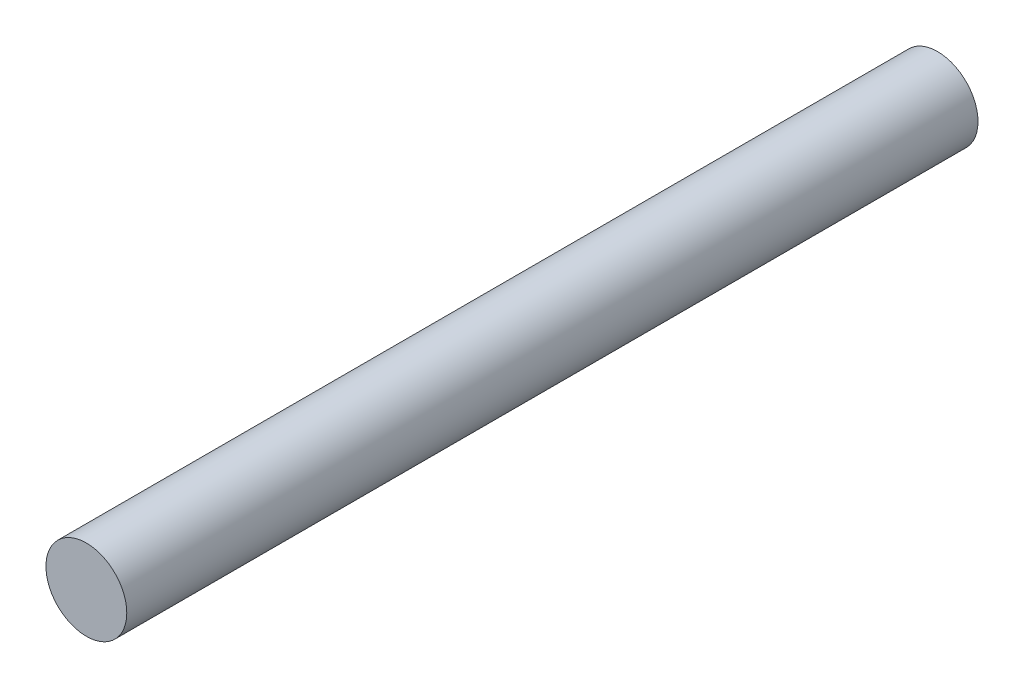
ISO-10303-21;
HEADER;
FILE_DESCRIPTION(('STEP AP214'),'2;1');
FILE_NAME('part.step','',(''),(''),'','','');
FILE_SCHEMA(('AUTOMOTIVE_DESIGN { 1 0 10303 214 1 1 1 1 }'));
ENDSEC;
DATA;
#1=APPLICATION_CONTEXT('core data for automotive mechanical design processes');
#2=APPLICATION_PROTOCOL_DEFINITION('international standard','automotive_design',2000,#1);
#3=PRODUCT_CONTEXT('',#1,'mechanical');
#4=PRODUCT('Part','Part','',(#3));
#5=PRODUCT_RELATED_PRODUCT_CATEGORY('part','',(#4));
#6=PRODUCT_DEFINITION_FORMATION('','',#4);
#7=PRODUCT_DEFINITION_CONTEXT('part definition',#1,'design');
#8=PRODUCT_DEFINITION('design','',#6,#7);
#9=PRODUCT_DEFINITION_SHAPE('','',#8);
#10=(LENGTH_UNIT() NAMED_UNIT(*) SI_UNIT(.MILLI.,.METRE.));
#11=(NAMED_UNIT(*) PLANE_ANGLE_UNIT() SI_UNIT($,.RADIAN.));
#12=(NAMED_UNIT(*) SI_UNIT($,.STERADIAN.) SOLID_ANGLE_UNIT());
#13=UNCERTAINTY_MEASURE_WITH_UNIT(LENGTH_MEASURE(1.E-05),#10,'distance_accuracy_value','');
#14=(GEOMETRIC_REPRESENTATION_CONTEXT(3) GLOBAL_UNCERTAINTY_ASSIGNED_CONTEXT((#13)) GLOBAL_UNIT_ASSIGNED_CONTEXT((#10,
#11,#12)) REPRESENTATION_CONTEXT('',''));
#15=CARTESIAN_POINT('',(0.,0.,0.));
#16=DIRECTION('',(0.,0.,1.));
#17=DIRECTION('',(1.,0.,0.));
#18=AXIS2_PLACEMENT_3D('',#15,#16,#17);
#19=CARTESIAN_POINT('',(0.,0.,101.6));
#20=DIRECTION('',(0.,0.,-1.));
#21=DIRECTION('',(-1.,0.,0.));
#22=AXIS2_PLACEMENT_3D('',#19,#20,#21);
#23=CYLINDRICAL_SURFACE('',#22,4.826);
#24=CARTESIAN_POINT('',(0.,0.,101.6));
#25=DIRECTION('',(0.,0.,1.));
#26=DIRECTION('',(1.,0.,0.));
#27=AXIS2_PLACEMENT_3D('',#24,#25,#26);
#28=CIRCLE('',#27,4.826);
#29=CARTESIAN_POINT('',(4.826,0.,101.6));
#30=VERTEX_POINT('',#29);
#31=EDGE_CURVE('E10',#30,#30,#28,.T.);
#32=ORIENTED_EDGE('',*,*,#31,.F.);
#33=EDGE_LOOP('',(#32));
#34=FACE_BOUND('',#33,.T.);
#35=CARTESIAN_POINT('',(0.,0.,0.));
#36=DIRECTION('',(0.,0.,1.));
#37=DIRECTION('',(1.,0.,0.));
#38=AXIS2_PLACEMENT_3D('',#35,#36,#37);
#39=CIRCLE('',#38,4.826);
#40=CARTESIAN_POINT('',(4.826,0.,0.));
#41=VERTEX_POINT('',#40);
#42=EDGE_CURVE('E33',#41,#41,#39,.T.);
#43=ORIENTED_EDGE('',*,*,#42,.T.);
#44=EDGE_LOOP('',(#43));
#45=FACE_BOUND('',#44,.T.);
#46=ADVANCED_FACE('F30',(#34,#45),#23,.T.);
#47=CARTESIAN_POINT('',(0.,0.,101.6));
#48=DIRECTION('',(0.,0.,1.));
#49=DIRECTION('',(1.,0.,0.));
#50=AXIS2_PLACEMENT_3D('',#47,#48,#49);
#51=PLANE('',#50);
#52=ORIENTED_EDGE('',*,*,#31,.T.);
#53=EDGE_LOOP('',(#52));
#54=FACE_BOUND('',#53,.T.);
#55=ADVANCED_FACE('F45',(#54),#51,.T.);
#56=CARTESIAN_POINT('',(0.,0.,0.));
#57=DIRECTION('',(0.,0.,1.));
#58=DIRECTION('',(1.,0.,0.));
#59=AXIS2_PLACEMENT_3D('',#56,#57,#58);
#60=PLANE('',#59);
#61=ORIENTED_EDGE('',*,*,#42,.F.);
#62=EDGE_LOOP('',(#61));
#63=FACE_BOUND('',#62,.T.);
#64=ADVANCED_FACE('F43',(#63),#60,.F.);
#65=CLOSED_SHELL('',(#46,#55,#64));
#66=MANIFOLD_SOLID_BREP('B2',#65);
#67=ADVANCED_BREP_SHAPE_REPRESENTATION('',(#18,#66),#14);
#68=SHAPE_DEFINITION_REPRESENTATION(#9,#67);
ENDSEC;
END-ISO-10303-21;
